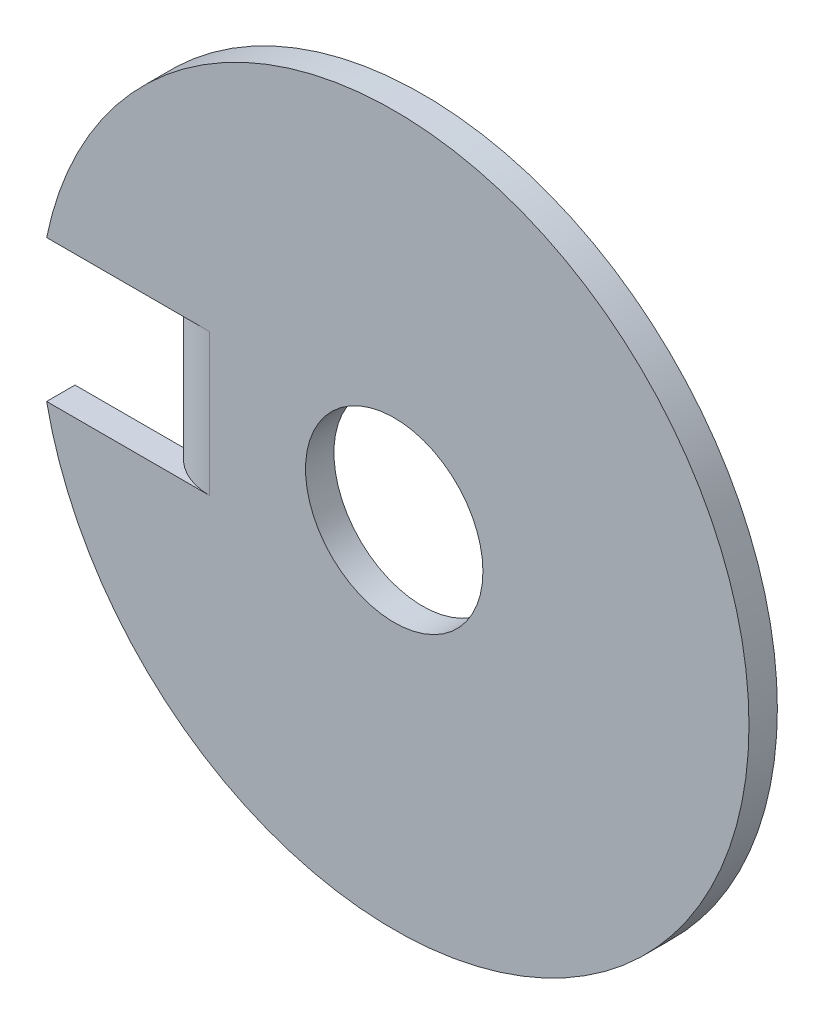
ISO-10303-21;
HEADER;
FILE_DESCRIPTION(('STEP AP214'),'2;1');
FILE_NAME('part.step','',(''),(''),'','','');
FILE_SCHEMA(('AUTOMOTIVE_DESIGN { 1 0 10303 214 1 1 1 1 }'));
ENDSEC;
DATA;
#1=APPLICATION_CONTEXT('core data for automotive mechanical design processes');
#2=APPLICATION_PROTOCOL_DEFINITION('international standard','automotive_design',2000,#1);
#3=PRODUCT_CONTEXT('',#1,'mechanical');
#4=PRODUCT('Part','Part','',(#3));
#5=PRODUCT_RELATED_PRODUCT_CATEGORY('part','',(#4));
#6=PRODUCT_DEFINITION_FORMATION('','',#4);
#7=PRODUCT_DEFINITION_CONTEXT('part definition',#1,'design');
#8=PRODUCT_DEFINITION('design','',#6,#7);
#9=PRODUCT_DEFINITION_SHAPE('','',#8);
#10=(LENGTH_UNIT() NAMED_UNIT(*) SI_UNIT(.MILLI.,.METRE.));
#11=(NAMED_UNIT(*) PLANE_ANGLE_UNIT() SI_UNIT($,.RADIAN.));
#12=(NAMED_UNIT(*) SI_UNIT($,.STERADIAN.) SOLID_ANGLE_UNIT());
#13=UNCERTAINTY_MEASURE_WITH_UNIT(LENGTH_MEASURE(1.E-05),#10,'distance_accuracy_value','');
#14=(GEOMETRIC_REPRESENTATION_CONTEXT(3) GLOBAL_UNCERTAINTY_ASSIGNED_CONTEXT((#13)) GLOBAL_UNIT_ASSIGNED_CONTEXT((#10,
#11,#12)) REPRESENTATION_CONTEXT('',''));
#15=CARTESIAN_POINT('',(0.,0.,0.));
#16=DIRECTION('',(0.,0.,1.));
#17=DIRECTION('',(1.,0.,0.));
#18=AXIS2_PLACEMENT_3D('',#15,#16,#17);
#19=CARTESIAN_POINT('',(0.,0.,0.4));
#20=DIRECTION('',(0.,0.,1.));
#21=DIRECTION('',(1.,0.,0.));
#22=AXIS2_PLACEMENT_3D('',#19,#20,#21);
#23=PLANE('',#22);
#24=CARTESIAN_POINT('',(0.,0.,0.4));
#25=DIRECTION('',(0.,0.,1.));
#26=DIRECTION('',(1.,0.,0.));
#27=AXIS2_PLACEMENT_3D('',#24,#25,#26);
#28=CIRCLE('',#27,1.25);
#29=CARTESIAN_POINT('',(1.25,0.,0.4));
#30=VERTEX_POINT('',#29);
#31=EDGE_CURVE('E115',#30,#30,#28,.T.);
#32=ORIENTED_EDGE('',*,*,#31,.F.);
#33=EDGE_LOOP('',(#32));
#34=FACE_BOUND('',#33,.T.);
#35=DIRECTION('',(1.,0.,0.));
#36=VECTOR('',#35,1.);
#37=CARTESIAN_POINT('',(-4.89897948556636,1.,0.4));
#38=LINE('',#37,#36);
#39=CARTESIAN_POINT('',(-4.89897948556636,1.,0.4));
#40=VERTEX_POINT('',#39);
#41=CARTESIAN_POINT('',(-2.6,1.,0.4));
#42=VERTEX_POINT('',#41);
#43=EDGE_CURVE('E127',#40,#42,#38,.T.);
#44=ORIENTED_EDGE('',*,*,#43,.T.);
#45=DIRECTION('',(0.,1.,0.));
#46=VECTOR('',#45,1.);
#47=CARTESIAN_POINT('',(-2.6,1.,0.399999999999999));
#48=LINE('',#47,#46);
#49=CARTESIAN_POINT('',(-2.6,-1.,0.4));
#50=VERTEX_POINT('',#49);
#51=EDGE_CURVE('E144',#42,#50,#48,.F.);
#52=ORIENTED_EDGE('',*,*,#51,.T.);
#53=DIRECTION('',(-1.,0.,0.));
#54=VECTOR('',#53,1.);
#55=CARTESIAN_POINT('',(-3.5,-1.,0.4));
#56=LINE('',#55,#54);
#57=CARTESIAN_POINT('',(-4.89897948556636,-1.,0.4));
#58=VERTEX_POINT('',#57);
#59=EDGE_CURVE('E81',#50,#58,#56,.T.);
#60=ORIENTED_EDGE('',*,*,#59,.T.);
#61=CARTESIAN_POINT('',(0.,0.,0.4));
#62=DIRECTION('',(0.,0.,1.));
#63=DIRECTION('',(1.,0.,0.));
#64=AXIS2_PLACEMENT_3D('',#61,#62,#63);
#65=CIRCLE('',#64,5.);
#66=EDGE_CURVE('E112',#58,#40,#65,.T.);
#67=ORIENTED_EDGE('',*,*,#66,.T.);
#68=EDGE_LOOP('',(#44,#52,#60,#67));
#69=FACE_BOUND('',#68,.T.);
#70=ADVANCED_FACE('F55',(#34,#69),#23,.T.);
#71=CARTESIAN_POINT('',(0.,0.,0.));
#72=DIRECTION('',(0.,0.,1.));
#73=DIRECTION('',(1.,0.,0.));
#74=AXIS2_PLACEMENT_3D('',#71,#72,#73);
#75=PLANE('',#74);
#76=CARTESIAN_POINT('',(0.,0.,0.));
#77=DIRECTION('',(0.,0.,1.));
#78=DIRECTION('',(1.,0.,0.));
#79=AXIS2_PLACEMENT_3D('',#76,#77,#78);
#80=CIRCLE('',#79,1.25);
#81=CARTESIAN_POINT('',(1.25,0.,0.));
#82=VERTEX_POINT('',#81);
#83=EDGE_CURVE('E119',#82,#82,#80,.T.);
#84=ORIENTED_EDGE('',*,*,#83,.T.);
#85=EDGE_LOOP('',(#84));
#86=FACE_BOUND('',#85,.T.);
#87=DIRECTION('',(0.,1.,0.));
#88=VECTOR('',#87,1.);
#89=CARTESIAN_POINT('',(-2.6,1.,0.));
#90=LINE('',#89,#88);
#91=CARTESIAN_POINT('',(-2.6,1.,0.));
#92=VERTEX_POINT('',#91);
#93=CARTESIAN_POINT('',(-2.6,-1.,0.));
#94=VERTEX_POINT('',#93);
#95=EDGE_CURVE('E136',#92,#94,#90,.F.);
#96=ORIENTED_EDGE('',*,*,#95,.F.);
#97=DIRECTION('',(1.,0.,0.));
#98=VECTOR('',#97,1.);
#99=CARTESIAN_POINT('',(-4.89897948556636,1.,0.));
#100=LINE('',#99,#98);
#101=CARTESIAN_POINT('',(-3.34833147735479,1.,0.));
#102=VERTEX_POINT('',#101);
#103=EDGE_CURVE('E72',#102,#92,#100,.T.);
#104=ORIENTED_EDGE('',*,*,#103,.F.);
#105=CARTESIAN_POINT('',(-4.89897948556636,1.,0.));
#106=VERTEX_POINT('',#105);
#107=EDGE_CURVE('E106',#106,#102,#100,.T.);
#108=ORIENTED_EDGE('',*,*,#107,.F.);
#109=CARTESIAN_POINT('',(0.,0.,0.));
#110=DIRECTION('',(0.,0.,1.));
#111=DIRECTION('',(1.,0.,0.));
#112=AXIS2_PLACEMENT_3D('',#109,#110,#111);
#113=CIRCLE('',#112,5.);
#114=CARTESIAN_POINT('',(-4.89897948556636,-1.,0.));
#115=VERTEX_POINT('',#114);
#116=EDGE_CURVE('E111',#115,#106,#113,.T.);
#117=ORIENTED_EDGE('',*,*,#116,.F.);
#118=DIRECTION('',(-1.,0.,0.));
#119=VECTOR('',#118,1.);
#120=CARTESIAN_POINT('',(-3.5,-1.,0.));
#121=LINE('',#120,#119);
#122=CARTESIAN_POINT('',(-3.34833147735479,-1.,0.));
#123=VERTEX_POINT('',#122);
#124=EDGE_CURVE('E94',#123,#115,#121,.T.);
#125=ORIENTED_EDGE('',*,*,#124,.F.);
#126=EDGE_CURVE('E105',#94,#123,#121,.T.);
#127=ORIENTED_EDGE('',*,*,#126,.F.);
#128=EDGE_LOOP('',(#96,#104,#108,#117,#125,#127));
#129=FACE_BOUND('',#128,.T.);
#130=ADVANCED_FACE('F113',(#86,#129),#75,.F.);
#131=CARTESIAN_POINT('',(0.,0.,0.4));
#132=DIRECTION('',(0.,0.,-1.));
#133=DIRECTION('',(-1.,0.,0.));
#134=AXIS2_PLACEMENT_3D('',#131,#132,#133);
#135=CYLINDRICAL_SURFACE('',#134,5.);
#136=ORIENTED_EDGE('',*,*,#116,.T.);
#137=DIRECTION('',(0.,0.,-1.));
#138=VECTOR('',#137,1.);
#139=CARTESIAN_POINT('',(-4.89897948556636,1.,0.4));
#140=LINE('',#139,#138);
#141=EDGE_CURVE('E59',#40,#106,#140,.T.);
#142=ORIENTED_EDGE('',*,*,#141,.F.);
#143=ORIENTED_EDGE('',*,*,#66,.F.);
#144=DIRECTION('',(0.,0.,-1.));
#145=VECTOR('',#144,1.);
#146=CARTESIAN_POINT('',(-4.89897948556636,-1.,0.4));
#147=LINE('',#146,#145);
#148=EDGE_CURVE('E97',#58,#115,#147,.T.);
#149=ORIENTED_EDGE('',*,*,#148,.T.);
#150=EDGE_LOOP('',(#136,#142,#143,#149));
#151=FACE_BOUND('',#150,.T.);
#152=ADVANCED_FACE('F57',(#151),#135,.T.);
#153=CARTESIAN_POINT('',(-4.89897948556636,1.,0.4));
#154=DIRECTION('',(0.,1.,0.));
#155=DIRECTION('',(0.,0.,1.));
#156=AXIS2_PLACEMENT_3D('',#153,#154,#155);
#157=PLANE('',#156);
#158=ORIENTED_EDGE('',*,*,#107,.T.);
#159=CARTESIAN_POINT('',(-2.6,1.,-0.5));
#160=DIRECTION('',(0.,1.,0.));
#161=DIRECTION('',(0.,0.,1.));
#162=AXIS2_PLACEMENT_3D('',#159,#160,#161);
#163=CIRCLE('',#162,0.9);
#164=EDGE_CURVE('E13',#102,#42,#163,.T.);
#165=ORIENTED_EDGE('',*,*,#164,.T.);
#166=ORIENTED_EDGE('',*,*,#43,.F.);
#167=ORIENTED_EDGE('',*,*,#141,.T.);
#168=EDGE_LOOP('',(#158,#165,#166,#167));
#169=FACE_BOUND('',#168,.T.);
#170=ADVANCED_FACE('F223',(#169),#157,.F.);
#171=CARTESIAN_POINT('',(-3.5,-1.,0.4));
#172=DIRECTION('',(0.,-1.,0.));
#173=DIRECTION('',(0.,0.,-1.));
#174=AXIS2_PLACEMENT_3D('',#171,#172,#173);
#175=PLANE('',#174);
#176=ORIENTED_EDGE('',*,*,#59,.F.);
#177=CARTESIAN_POINT('',(-2.6,-1.,-0.5));
#178=DIRECTION('',(0.,1.,0.));
#179=DIRECTION('',(0.,0.,1.));
#180=AXIS2_PLACEMENT_3D('',#177,#178,#179);
#181=CIRCLE('',#180,0.9);
#182=EDGE_CURVE('E101',#50,#123,#181,.F.);
#183=ORIENTED_EDGE('',*,*,#182,.T.);
#184=ORIENTED_EDGE('',*,*,#124,.T.);
#185=ORIENTED_EDGE('',*,*,#148,.F.);
#186=EDGE_LOOP('',(#176,#183,#184,#185));
#187=FACE_BOUND('',#186,.T.);
#188=ADVANCED_FACE('F96',(#187),#175,.F.);
#189=CARTESIAN_POINT('',(0.,0.,0.4));
#190=DIRECTION('',(0.,0.,-1.));
#191=DIRECTION('',(-1.,0.,0.));
#192=AXIS2_PLACEMENT_3D('',#189,#190,#191);
#193=CYLINDRICAL_SURFACE('',#192,1.25);
#194=ORIENTED_EDGE('',*,*,#31,.T.);
#195=EDGE_LOOP('',(#194));
#196=FACE_BOUND('',#195,.T.);
#197=ORIENTED_EDGE('',*,*,#83,.F.);
#198=EDGE_LOOP('',(#197));
#199=FACE_BOUND('',#198,.T.);
#200=ADVANCED_FACE('F232',(#196,#199),#193,.F.);
#201=CARTESIAN_POINT('',(-2.6,-1.,-0.5));
#202=DIRECTION('',(0.,-1.,0.));
#203=DIRECTION('',(0.,0.,-1.));
#204=AXIS2_PLACEMENT_3D('',#201,#202,#203);
#205=PLANE('',#204);
#206=CARTESIAN_POINT('',(-2.6,-1.,-0.5));
#207=DIRECTION('',(0.,1.,0.));
#208=DIRECTION('',(0.,0.,1.));
#209=AXIS2_PLACEMENT_3D('',#206,#207,#208);
#210=CIRCLE('',#209,0.5);
#211=CARTESIAN_POINT('',(-3.1,-1.,-0.499999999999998));
#212=VERTEX_POINT('',#211);
#213=EDGE_CURVE('E140',#94,#212,#210,.F.);
#214=ORIENTED_EDGE('',*,*,#213,.F.);
#215=ORIENTED_EDGE('',*,*,#126,.T.);
#216=CARTESIAN_POINT('',(-3.5,-1.,-0.499999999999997));
#217=VERTEX_POINT('',#216);
#218=EDGE_CURVE('E146',#123,#217,#181,.F.);
#219=ORIENTED_EDGE('',*,*,#218,.T.);
#220=DIRECTION('',(1.,0.,0.));
#221=VECTOR('',#220,1.);
#222=CARTESIAN_POINT('',(-3.5,-1.,-0.499999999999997));
#223=LINE('',#222,#221);
#224=EDGE_CURVE('E148',#212,#217,#223,.F.);
#225=ORIENTED_EDGE('',*,*,#224,.F.);
#226=EDGE_LOOP('',(#214,#215,#219,#225));
#227=FACE_BOUND('',#226,.T.);
#228=ADVANCED_FACE('F229',(#227),#205,.T.);
#229=CARTESIAN_POINT('',(-2.6,1.,-0.5));
#230=DIRECTION('',(0.,-1.,0.));
#231=DIRECTION('',(0.,0.,-1.));
#232=AXIS2_PLACEMENT_3D('',#229,#230,#231);
#233=PLANE('',#232);
#234=CARTESIAN_POINT('',(-3.5,1.,-0.499999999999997));
#235=VERTEX_POINT('',#234);
#236=EDGE_CURVE('E65',#235,#102,#163,.T.);
#237=ORIENTED_EDGE('',*,*,#236,.T.);
#238=ORIENTED_EDGE('',*,*,#103,.T.);
#239=CARTESIAN_POINT('',(-2.6,1.,-0.5));
#240=DIRECTION('',(0.,1.,0.));
#241=DIRECTION('',(0.,0.,1.));
#242=AXIS2_PLACEMENT_3D('',#239,#240,#241);
#243=CIRCLE('',#242,0.5);
#244=CARTESIAN_POINT('',(-3.1,1.,-0.499999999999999));
#245=VERTEX_POINT('',#244);
#246=EDGE_CURVE('E133',#245,#92,#243,.T.);
#247=ORIENTED_EDGE('',*,*,#246,.F.);
#248=DIRECTION('',(1.,0.,0.));
#249=VECTOR('',#248,1.);
#250=CARTESIAN_POINT('',(-3.1,1.,-0.499999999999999));
#251=LINE('',#250,#249);
#252=EDGE_CURVE('E154',#245,#235,#251,.F.);
#253=ORIENTED_EDGE('',*,*,#252,.T.);
#254=EDGE_LOOP('',(#237,#238,#247,#253));
#255=FACE_BOUND('',#254,.T.);
#256=ADVANCED_FACE('F231',(#255),#233,.F.);
#257=CARTESIAN_POINT('',(-2.6,1.,-0.5));
#258=DIRECTION('',(0.,1.,0.));
#259=DIRECTION('',(-1.,0.,0.));
#260=AXIS2_PLACEMENT_3D('',#257,#258,#259);
#261=CYLINDRICAL_SURFACE('',#260,0.9);
#262=ORIENTED_EDGE('',*,*,#51,.F.);
#263=ORIENTED_EDGE('',*,*,#164,.F.);
#264=ORIENTED_EDGE('',*,*,#236,.F.);
#265=DIRECTION('',(0.,1.,0.));
#266=VECTOR('',#265,1.);
#267=CARTESIAN_POINT('',(-3.5,-1.,-0.499999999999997));
#268=LINE('',#267,#266);
#269=EDGE_CURVE('E157',#235,#217,#268,.F.);
#270=ORIENTED_EDGE('',*,*,#269,.T.);
#271=ORIENTED_EDGE('',*,*,#218,.F.);
#272=ORIENTED_EDGE('',*,*,#182,.F.);
#273=EDGE_LOOP('',(#262,#263,#264,#270,#271,#272));
#274=FACE_BOUND('',#273,.T.);
#275=ADVANCED_FACE('F227',(#274),#261,.T.);
#276=CARTESIAN_POINT('',(-2.6,1.,-0.5));
#277=DIRECTION('',(0.,1.,0.));
#278=DIRECTION('',(-1.,0.,0.));
#279=AXIS2_PLACEMENT_3D('',#276,#277,#278);
#280=CYLINDRICAL_SURFACE('',#279,0.5);
#281=ORIENTED_EDGE('',*,*,#95,.T.);
#282=ORIENTED_EDGE('',*,*,#213,.T.);
#283=DIRECTION('',(0.,1.,0.));
#284=VECTOR('',#283,1.);
#285=CARTESIAN_POINT('',(-3.1,-1.,-0.499999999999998));
#286=LINE('',#285,#284);
#287=EDGE_CURVE('E151',#212,#245,#286,.T.);
#288=ORIENTED_EDGE('',*,*,#287,.T.);
#289=ORIENTED_EDGE('',*,*,#246,.T.);
#290=EDGE_LOOP('',(#281,#282,#288,#289));
#291=FACE_BOUND('',#290,.T.);
#292=ADVANCED_FACE('F302',(#291),#280,.F.);
#293=CARTESIAN_POINT('',(-3.5,1.,-1.1));
#294=DIRECTION('',(0.,-1.,0.));
#295=DIRECTION('',(0.,0.,-1.));
#296=AXIS2_PLACEMENT_3D('',#293,#294,#295);
#297=PLANE('',#296);
#298=ORIENTED_EDGE('',*,*,#252,.F.);
#299=DIRECTION('',(0.,0.,1.));
#300=VECTOR('',#299,1.);
#301=CARTESIAN_POINT('',(-3.1,1.,-1.1));
#302=LINE('',#301,#300);
#303=CARTESIAN_POINT('',(-3.1,1.,-1.1));
#304=VERTEX_POINT('',#303);
#305=EDGE_CURVE('E160',#245,#304,#302,.F.);
#306=ORIENTED_EDGE('',*,*,#305,.T.);
#307=DIRECTION('',(1.,0.,0.));
#308=VECTOR('',#307,1.);
#309=CARTESIAN_POINT('',(-3.5,1.,-1.1));
#310=LINE('',#309,#308);
#311=CARTESIAN_POINT('',(-3.5,1.,-1.1));
#312=VERTEX_POINT('',#311);
#313=EDGE_CURVE('E137',#312,#304,#310,.T.);
#314=ORIENTED_EDGE('',*,*,#313,.F.);
#315=DIRECTION('',(0.,0.,-1.));
#316=VECTOR('',#315,1.);
#317=CARTESIAN_POINT('',(-3.5,1.,0.));
#318=LINE('',#317,#316);
#319=EDGE_CURVE('E169',#235,#312,#318,.T.);
#320=ORIENTED_EDGE('',*,*,#319,.F.);
#321=EDGE_LOOP('',(#298,#306,#314,#320));
#322=FACE_BOUND('',#321,.T.);
#323=ADVANCED_FACE('F312',(#322),#297,.F.);
#324=CARTESIAN_POINT('',(-3.5,-1.,0.));
#325=DIRECTION('',(0.,1.,0.));
#326=DIRECTION('',(-1.,0.,0.));
#327=AXIS2_PLACEMENT_3D('',#324,#325,#326);
#328=PLANE('',#327);
#329=ORIENTED_EDGE('',*,*,#224,.T.);
#330=DIRECTION('',(0.,0.,1.));
#331=VECTOR('',#330,1.);
#332=CARTESIAN_POINT('',(-3.5,-1.,0.));
#333=LINE('',#332,#331);
#334=CARTESIAN_POINT('',(-3.5,-1.,-1.1));
#335=VERTEX_POINT('',#334);
#336=EDGE_CURVE('E175',#335,#217,#333,.T.);
#337=ORIENTED_EDGE('',*,*,#336,.F.);
#338=DIRECTION('',(1.,0.,0.));
#339=VECTOR('',#338,1.);
#340=CARTESIAN_POINT('',(-3.5,-1.,-1.1));
#341=LINE('',#340,#339);
#342=CARTESIAN_POINT('',(-3.1,-1.,-1.1));
#343=VERTEX_POINT('',#342);
#344=EDGE_CURVE('E178',#335,#343,#341,.T.);
#345=ORIENTED_EDGE('',*,*,#344,.T.);
#346=DIRECTION('',(0.,0.,-1.));
#347=VECTOR('',#346,1.);
#348=CARTESIAN_POINT('',(-3.1,-1.,0.));
#349=LINE('',#348,#347);
#350=EDGE_CURVE('E166',#343,#212,#349,.F.);
#351=ORIENTED_EDGE('',*,*,#350,.T.);
#352=EDGE_LOOP('',(#329,#337,#345,#351));
#353=FACE_BOUND('',#352,.T.);
#354=ADVANCED_FACE('F204',(#353),#328,.F.);
#355=CARTESIAN_POINT('',(-3.5,-1.,0.));
#356=DIRECTION('',(1.,0.,0.));
#357=DIRECTION('',(0.,0.,-1.));
#358=AXIS2_PLACEMENT_3D('',#355,#356,#357);
#359=PLANE('',#358);
#360=ORIENTED_EDGE('',*,*,#269,.F.);
#361=ORIENTED_EDGE('',*,*,#319,.T.);
#362=DIRECTION('',(0.,-1.,0.));
#363=VECTOR('',#362,1.);
#364=CARTESIAN_POINT('',(-3.5,-1.,-1.1));
#365=LINE('',#364,#363);
#366=EDGE_CURVE('E172',#312,#335,#365,.T.);
#367=ORIENTED_EDGE('',*,*,#366,.T.);
#368=ORIENTED_EDGE('',*,*,#336,.T.);
#369=EDGE_LOOP('',(#360,#361,#367,#368));
#370=FACE_BOUND('',#369,.T.);
#371=ADVANCED_FACE('F331',(#370),#359,.F.);
#372=CARTESIAN_POINT('',(-3.1,-1.,0.));
#373=DIRECTION('',(1.,0.,0.));
#374=DIRECTION('',(0.,0.,-1.));
#375=AXIS2_PLACEMENT_3D('',#372,#373,#374);
#376=PLANE('',#375);
#377=ORIENTED_EDGE('',*,*,#305,.F.);
#378=ORIENTED_EDGE('',*,*,#287,.F.);
#379=ORIENTED_EDGE('',*,*,#350,.F.);
#380=DIRECTION('',(0.,1.,0.));
#381=VECTOR('',#380,1.);
#382=CARTESIAN_POINT('',(-3.1,-1.,-1.1));
#383=LINE('',#382,#381);
#384=EDGE_CURVE('E163',#304,#343,#383,.F.);
#385=ORIENTED_EDGE('',*,*,#384,.F.);
#386=EDGE_LOOP('',(#377,#378,#379,#385));
#387=FACE_BOUND('',#386,.T.);
#388=ADVANCED_FACE('F198',(#387),#376,.T.);
#389=CARTESIAN_POINT('',(-3.5,-1.,-1.1));
#390=DIRECTION('',(0.,0.,1.));
#391=DIRECTION('',(1.,0.,0.));
#392=AXIS2_PLACEMENT_3D('',#389,#390,#391);
#393=PLANE('',#392);
#394=ORIENTED_EDGE('',*,*,#384,.T.);
#395=ORIENTED_EDGE('',*,*,#344,.F.);
#396=ORIENTED_EDGE('',*,*,#366,.F.);
#397=ORIENTED_EDGE('',*,*,#313,.T.);
#398=EDGE_LOOP('',(#394,#395,#396,#397));
#399=FACE_BOUND('',#398,.T.);
#400=ADVANCED_FACE('F187',(#399),#393,.F.);
#401=CLOSED_SHELL('',(#70,#130,#152,#170,#188,#200,#228,#256,#275,#292,#323,#354,#371,#388,#400));
#402=MANIFOLD_SOLID_BREP('B2',#401);
#403=ADVANCED_BREP_SHAPE_REPRESENTATION('',(#18,#402),#14);
#404=SHAPE_DEFINITION_REPRESENTATION(#9,#403);
ENDSEC;
END-ISO-10303-21;
